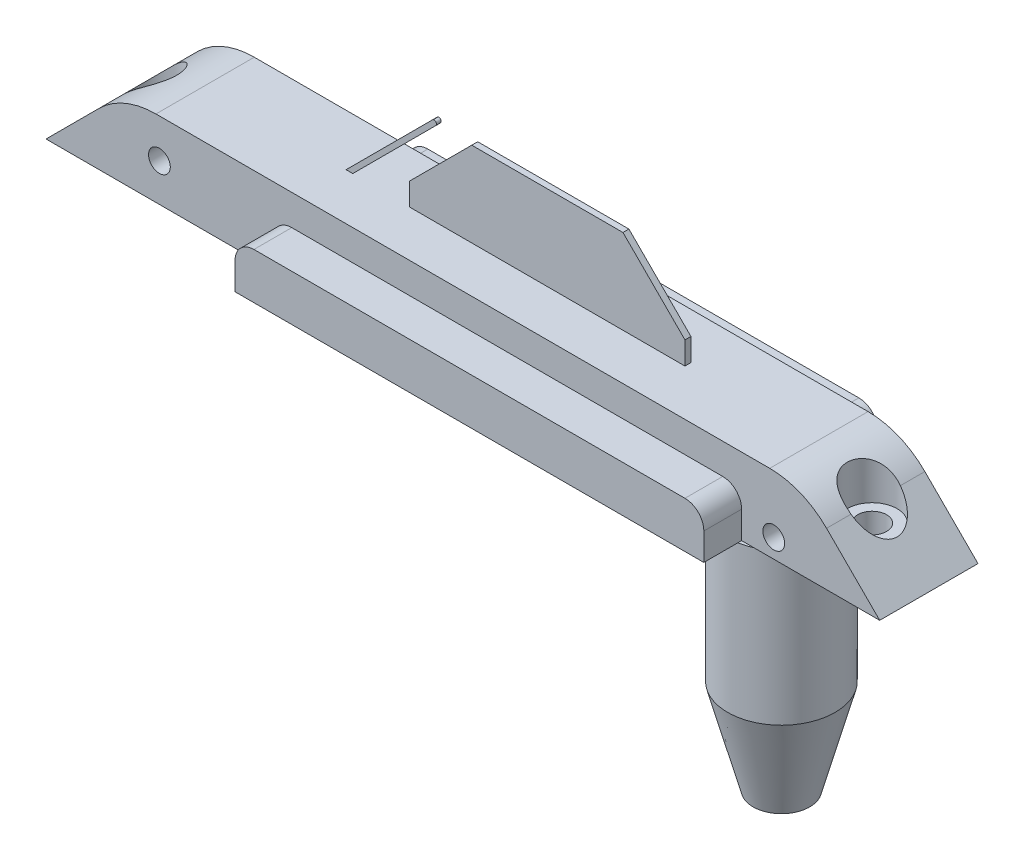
from build123d import *

# Parameters (mm, degrees)
SKETCH1_W                                      = 140.0302
SKETCH1_H                                      = 16.51
EXTRUDE1_DEPTH                                 = 12.8778
EXTRUDE2_DEPTH                                 = 0.396875
EXTRUDE5_DEPTH                                 = 119.78715622
EXTRUDE5_DEPTH_BACK                            = 119.78715622
FILLET3_R                                      = 13.49375
CBORE_FOR_8_SOCKET_HEAD_CAP_SCREW1_D           = 4.8768
CBORE_FOR_8_SOCKET_HEAD_CAP_SCREW1_CBORE_D     = 8.382
CBORE_FOR_8_SOCKET_HEAD_CAP_SCREW1_CBORE_DEPTH = 7.62
BLADE_DEPTH                                    = 0.5
EXTRUDE9_DEPTH                                 = 14.605
F_27_0_144_DIAMETER_HOLE1_D                    = 3.6576
SKETCH10_R                                     = 9.017
EXTRUDE7_DEPTH                                 = 25.4
SKETCH11_R                                     = 9.017
EXTRUDE8_DEPTH                                 = 15.875
EXTRUDE8_TAPER                                 = 15


with BuildPart() as part:
    # Sketch1 → Extrude1 (new body)
    with BuildSketch(Plane(origin=(0, 0, 0), x_dir=(1, 0, 0), z_dir=(0, 1, 0))):
        with Locations((-45.2501, 0)):
            Rectangle(SKETCH1_W, SKETCH1_H)
    extrude(amount=EXTRUDE1_DEPTH)

    # Sketch2 → Extrude2 (add, symmetric)
    with BuildSketch(Plane.XY):
        with BuildLine():
            Line((-72.7202, 12.8778), (-72.158933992, 12.316533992))
            Line((-72.158933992, 12.316533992), (-57.654300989, 26.821166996))
            ThreePointArc((-57.654300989, 26.821166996), (-57.654300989, 27.382433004), (-58.215566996, 27.382433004))
            Line((-58.215566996, 27.382433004), (-72.7202, 12.8778))
        make_face()
    extrude(amount=EXTRUDE2_DEPTH, both=True)

    # Sketch7 → Extrude5 (cut, two sides: drawn at the far end of the back side and taken through both)
    with BuildSketch(Plane.XY.offset(-EXTRUDE5_DEPTH_BACK)):
        Polygon((11.8872, 12.8778), (24.765, 0), (24.765, 12.8778), align=None)
        Polygon((-102.3874, 12.8778), (-115.2652, 12.8778), (-115.2652, 0), align=None)
    extrude(amount=EXTRUDE5_DEPTH + EXTRUDE5_DEPTH_BACK, mode=Mode.SUBTRACT)

    # Fillet3
    fillet3_edges = [part.edges().sort_by_distance(p)[0] for p in [
        (11.8872, 12.8778, 0),
        (-102.3874, 12.8778, 0),
    ]]
    fillet(fillet3_edges, radius=FILLET3_R)

    # CBORE for _8 Socket Head Cap Screw1 (through all)
    with Locations(Plane(origin=(0, 12.8778, 0), x_dir=(-1, 0, 0), z_dir=(0, 1, 0))):
        with Locations((105.7402, 0), (-15.24, 0)):
            CounterBoreHole(CBORE_FOR_8_SOCKET_HEAD_CAP_SCREW1_D / 2, CBORE_FOR_8_SOCKET_HEAD_CAP_SCREW1_CBORE_D / 2, CBORE_FOR_8_SOCKET_HEAD_CAP_SCREW1_CBORE_DEPTH)

    # Sketch12 → Blade (add, symmetric)
    with BuildSketch(Plane.XY):
        Polygon((-15.6972, 16.6878), (-26.1112, 27.1018), (-51.5112, 27.1018), (-61.9252, 16.6878), (-61.9252, 12.8778), (-15.6972, 12.8778), align=None)
    extrude(amount=BLADE_DEPTH, both=True)

    # Sketch13 → Extrude9 (add, symmetric)
    with BuildSketch(Plane.XY):
        with BuildLine():
            Line((-77.1652, 0), (-77.1652, 4.572))
            ThreePointArc((-77.1652, 4.572), (-76.23526403, 6.81706403), (-73.9902, 7.747))
            Line((-73.9902, 7.747), (-1.6002, 7.747))
            ThreePointArc((-1.6002, 7.747), (0.64486403, 6.81706403), (1.5748, 4.572))
            Line((1.5748, 4.572), (1.5748, 0))
            Line((1.5748, 0), (-77.1652, 0))
        make_face()
    extrude(amount=EXTRUDE9_DEPTH, both=True)

    # 27 _0.144_ Diameter Hole1 (through all)
    with Locations(Plane(origin=(0, 0, -8.255), x_dir=(-1, 0, 0), z_dir=(0, 0, -1))):
        with Locations((-6.9723, 3.175), (96.2152, 6.35)):
            Hole(F_27_0_144_DIAMETER_HOLE1_D / 2)

    # Sketch10 → Extrude7 (add)
    with BuildSketch(Plane.XZ):
        with Locations(Location((0, 0, 0), (0, 0, 79.941832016))):
            Circle(SKETCH10_R)
    extrude(amount=EXTRUDE7_DEPTH)

    # Sketch11 → Extrude8 (add)
    with BuildSketch(Plane.XZ.offset(25.4)):
        with Locations(Location((0, 0, 0), (0, 0, 79.941832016))):
            Circle(SKETCH11_R)
    extrude(amount=EXTRUDE8_DEPTH, taper=EXTRUDE8_TAPER)


solid = part.part
